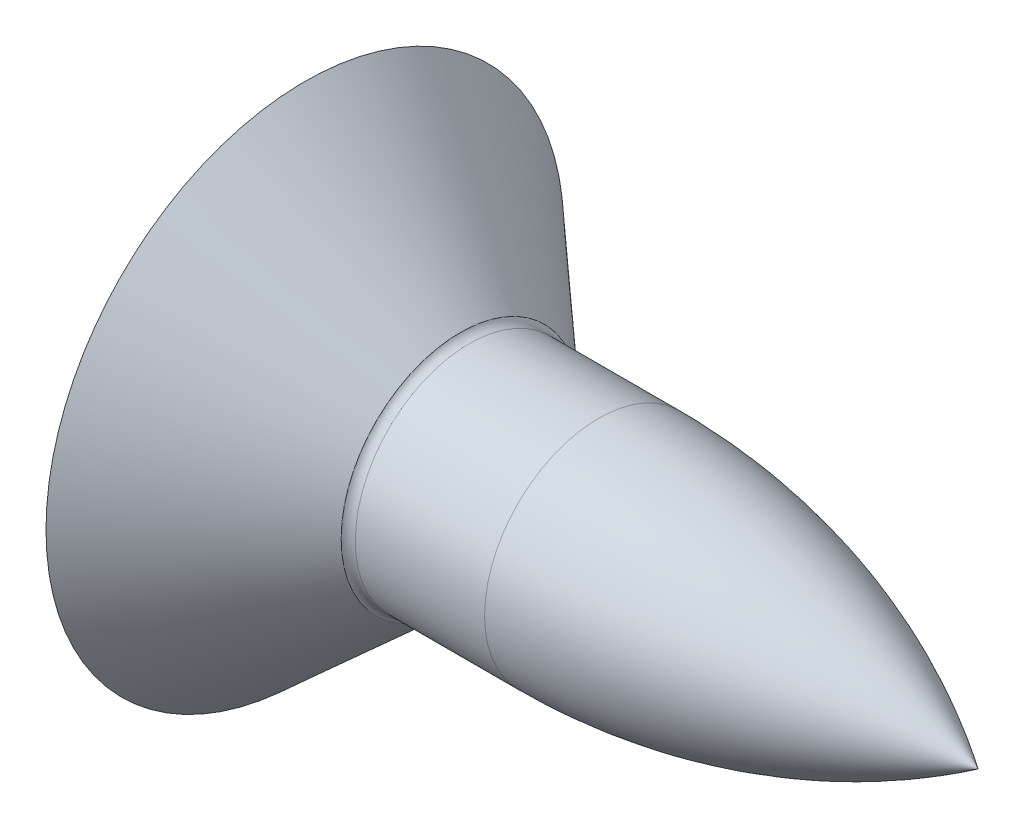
ISO-10303-21;
HEADER;
FILE_DESCRIPTION(('STEP AP214'),'2;1');
FILE_NAME('part.step','',(''),(''),'','','');
FILE_SCHEMA(('AUTOMOTIVE_DESIGN { 1 0 10303 214 1 1 1 1 }'));
ENDSEC;
DATA;
#1=APPLICATION_CONTEXT('core data for automotive mechanical design processes');
#2=APPLICATION_PROTOCOL_DEFINITION('international standard','automotive_design',2000,#1);
#3=PRODUCT_CONTEXT('',#1,'mechanical');
#4=PRODUCT('Part','Part','',(#3));
#5=PRODUCT_RELATED_PRODUCT_CATEGORY('part','',(#4));
#6=PRODUCT_DEFINITION_FORMATION('','',#4);
#7=PRODUCT_DEFINITION_CONTEXT('part definition',#1,'design');
#8=PRODUCT_DEFINITION('design','',#6,#7);
#9=PRODUCT_DEFINITION_SHAPE('','',#8);
#10=(LENGTH_UNIT() NAMED_UNIT(*) SI_UNIT(.MILLI.,.METRE.));
#11=(NAMED_UNIT(*) PLANE_ANGLE_UNIT() SI_UNIT($,.RADIAN.));
#12=(NAMED_UNIT(*) SI_UNIT($,.STERADIAN.) SOLID_ANGLE_UNIT());
#13=UNCERTAINTY_MEASURE_WITH_UNIT(LENGTH_MEASURE(1.E-05),#10,'distance_accuracy_value','');
#14=(GEOMETRIC_REPRESENTATION_CONTEXT(3) GLOBAL_UNCERTAINTY_ASSIGNED_CONTEXT((#13)) GLOBAL_UNIT_ASSIGNED_CONTEXT((#10,
#11,#12)) REPRESENTATION_CONTEXT('',''));
#15=CARTESIAN_POINT('',(0.,0.,0.));
#16=DIRECTION('',(0.,0.,1.));
#17=DIRECTION('',(1.,0.,0.));
#18=AXIS2_PLACEMENT_3D('',#15,#16,#17);
#19=CARTESIAN_POINT('',(0.,0.,0.));
#20=DIRECTION('',(-1.,0.,0.));
#21=DIRECTION('',(0.,0.,1.));
#22=AXIS2_PLACEMENT_3D('',#19,#20,#21);
#23=PLANE('',#22);
#24=CARTESIAN_POINT('',(0.,0.,0.));
#25=DIRECTION('',(-1.,0.,0.));
#26=DIRECTION('',(0.,0.,1.));
#27=AXIS2_PLACEMENT_3D('',#24,#25,#26);
#28=CIRCLE('',#27,2.5);
#29=CARTESIAN_POINT('',(0.,0.,2.5));
#30=VERTEX_POINT('',#29);
#31=EDGE_CURVE('E214',#30,#30,#28,.T.);
#32=ORIENTED_EDGE('',*,*,#31,.T.);
#33=EDGE_LOOP('',(#32));
#34=FACE_BOUND('',#33,.T.);
#35=DIRECTION('',(0.,0.,-1.));
#36=VECTOR('',#35,1.);
#37=CARTESIAN_POINT('',(0.,-0.370000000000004,1.3));
#38=LINE('',#37,#36);
#39=CARTESIAN_POINT('',(0.,-0.370000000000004,1.3));
#40=VERTEX_POINT('',#39);
#41=CARTESIAN_POINT('',(0.,-0.370000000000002,0.547609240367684));
#42=VERTEX_POINT('',#41);
#43=EDGE_CURVE('E468',#40,#42,#38,.T.);
#44=ORIENTED_EDGE('',*,*,#43,.T.);
#45=CARTESIAN_POINT('',(0.,0.,0.));
#46=DIRECTION('',(-1.,0.,0.));
#47=DIRECTION('',(0.,0.,1.));
#48=AXIS2_PLACEMENT_3D('',#45,#46,#47);
#49=CIRCLE('',#48,0.660890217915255);
#50=CARTESIAN_POINT('',(0.,-0.547609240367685,0.369999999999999));
#51=VERTEX_POINT('',#50);
#52=EDGE_CURVE('E343',#51,#42,#49,.T.);
#53=ORIENTED_EDGE('',*,*,#52,.F.);
#54=DIRECTION('',(0.,-1.,0.));
#55=VECTOR('',#54,1.);
#56=CARTESIAN_POINT('',(0.,1.3,0.37));
#57=LINE('',#56,#55);
#58=CARTESIAN_POINT('',(0.,-1.3,0.369999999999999));
#59=VERTEX_POINT('',#58);
#60=EDGE_CURVE('E416',#51,#59,#57,.T.);
#61=ORIENTED_EDGE('',*,*,#60,.T.);
#62=DIRECTION('',(0.,0.,1.));
#63=VECTOR('',#62,1.);
#64=CARTESIAN_POINT('',(0.,-1.3,-0.37));
#65=LINE('',#64,#63);
#66=CARTESIAN_POINT('',(0.,-1.3,-0.37));
#67=VERTEX_POINT('',#66);
#68=EDGE_CURVE('E219',#67,#59,#65,.T.);
#69=ORIENTED_EDGE('',*,*,#68,.F.);
#70=DIRECTION('',(0.,1.,0.));
#71=VECTOR('',#70,1.);
#72=CARTESIAN_POINT('',(0.,-1.3,-0.37));
#73=LINE('',#72,#71);
#74=CARTESIAN_POINT('',(0.,-0.547609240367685,-0.37));
#75=VERTEX_POINT('',#74);
#76=EDGE_CURVE('E49',#67,#75,#73,.T.);
#77=ORIENTED_EDGE('',*,*,#76,.T.);
#78=CARTESIAN_POINT('',(0.,-0.369999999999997,-0.547609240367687));
#79=VERTEX_POINT('',#78);
#80=EDGE_CURVE('E346',#79,#75,#49,.T.);
#81=ORIENTED_EDGE('',*,*,#80,.F.);
#82=CARTESIAN_POINT('',(0.,-0.369999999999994,-1.3));
#83=VERTEX_POINT('',#82);
#84=EDGE_CURVE('E467',#79,#83,#38,.T.);
#85=ORIENTED_EDGE('',*,*,#84,.T.);
#86=DIRECTION('',(0.,-1.,0.));
#87=VECTOR('',#86,1.);
#88=CARTESIAN_POINT('',(0.,0.370000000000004,-1.3));
#89=LINE('',#88,#87);
#90=CARTESIAN_POINT('',(0.,0.370000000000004,-1.3));
#91=VERTEX_POINT('',#90);
#92=EDGE_CURVE('E427',#91,#83,#89,.T.);
#93=ORIENTED_EDGE('',*,*,#92,.F.);
#94=DIRECTION('',(0.,0.,1.));
#95=VECTOR('',#94,1.);
#96=CARTESIAN_POINT('',(0.,0.370000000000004,-1.3));
#97=LINE('',#96,#95);
#98=CARTESIAN_POINT('',(0.,0.370000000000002,-0.547609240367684));
#99=VERTEX_POINT('',#98);
#100=EDGE_CURVE('E461',#91,#99,#97,.T.);
#101=ORIENTED_EDGE('',*,*,#100,.T.);
#102=CARTESIAN_POINT('',(0.,0.547609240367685,-0.37));
#103=VERTEX_POINT('',#102);
#104=EDGE_CURVE('E342',#103,#99,#49,.T.);
#105=ORIENTED_EDGE('',*,*,#104,.F.);
#106=CARTESIAN_POINT('',(0.,1.3,-0.37));
#107=VERTEX_POINT('',#106);
#108=EDGE_CURVE('E410',#103,#107,#73,.T.);
#109=ORIENTED_EDGE('',*,*,#108,.T.);
#110=DIRECTION('',(0.,0.,-1.));
#111=VECTOR('',#110,1.);
#112=CARTESIAN_POINT('',(0.,1.3,0.37));
#113=LINE('',#112,#111);
#114=CARTESIAN_POINT('',(0.,1.3,0.37));
#115=VERTEX_POINT('',#114);
#116=EDGE_CURVE('E417',#115,#107,#113,.T.);
#117=ORIENTED_EDGE('',*,*,#116,.F.);
#118=CARTESIAN_POINT('',(0.,0.547609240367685,0.37));
#119=VERTEX_POINT('',#118);
#120=EDGE_CURVE('E414',#115,#119,#57,.T.);
#121=ORIENTED_EDGE('',*,*,#120,.T.);
#122=CARTESIAN_POINT('',(0.,0.369999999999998,0.547609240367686));
#123=VERTEX_POINT('',#122);
#124=EDGE_CURVE('E338',#123,#119,#49,.T.);
#125=ORIENTED_EDGE('',*,*,#124,.F.);
#126=CARTESIAN_POINT('',(0.,0.369999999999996,1.3));
#127=VERTEX_POINT('',#126);
#128=EDGE_CURVE('E464',#123,#127,#97,.T.);
#129=ORIENTED_EDGE('',*,*,#128,.T.);
#130=DIRECTION('',(0.,1.,0.));
#131=VECTOR('',#130,1.);
#132=CARTESIAN_POINT('',(0.,-0.370000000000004,1.3));
#133=LINE('',#132,#131);
#134=EDGE_CURVE('E463',#40,#127,#133,.T.);
#135=ORIENTED_EDGE('',*,*,#134,.F.);
#136=EDGE_LOOP('',(#44,#53,#61,#69,#77,#81,#85,#93,#101,#105,#109,#117,#121,#125,#129,#135));
#137=FACE_BOUND('',#136,.T.);
#138=ADVANCED_FACE('F26',(#34,#137),#23,.T.);
#139=CARTESIAN_POINT('',(1.5,0.552127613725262,-0.37));
#140=DIRECTION('',(0.,0.,1.));
#141=DIRECTION('',(0.,-1.,0.));
#142=AXIS2_PLACEMENT_3D('',#139,#140,#141);
#143=PLANE('',#142);
#144=ORIENTED_EDGE('',*,*,#108,.F.);
#145=CARTESIAN_POINT('',(-1.01786528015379,0.631681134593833,-0.37));
#146=CARTESIAN_POINT('',(-0.81671122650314,0.615372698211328,-0.37));
#147=CARTESIAN_POINT('',(-0.615568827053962,0.598917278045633,-0.37));
#148=CARTESIAN_POINT('',(-0.213313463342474,0.565594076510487,-0.37));
#149=CARTESIAN_POINT('',(-0.0122004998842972,0.548726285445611,-0.37));
#150=CARTESIAN_POINT('',(0.38998037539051,0.514460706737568,-0.37));
#151=CARTESIAN_POINT('',(0.591048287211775,0.497062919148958,-0.37));
#152=CARTESIAN_POINT('',(0.993117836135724,0.461546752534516,-0.37));
#153=CARTESIAN_POINT('',(1.19411947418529,0.443428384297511,-0.37));
#154=CARTESIAN_POINT('',(1.51280354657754,0.413874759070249,-0.37));
#155=CARTESIAN_POINT('',(1.63051742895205,0.402779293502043,-0.37));
#156=CARTESIAN_POINT('',(1.86590055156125,0.380130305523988,-0.37));
#157=CARTESIAN_POINT('',(1.98356979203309,0.368576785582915,-0.37));
#158=CARTESIAN_POINT('',(2.21885433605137,0.344876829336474,-0.37));
#159=CARTESIAN_POINT('',(2.33646963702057,0.332730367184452,-0.37));
#160=CARTESIAN_POINT('',(2.57161134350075,0.30758754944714,-0.37));
#161=CARTESIAN_POINT('',(2.68913774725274,0.294591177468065,-0.37));
#162=CARTESIAN_POINT('',(2.80660252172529,0.281041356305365,-0.37));
#163=B_SPLINE_CURVE_WITH_KNOTS('',3,(#145,#146,#147,#148,#149,#150,#151,#152,#153,#154,#155,
#156,#157,#158,#159,#160,#161,#162),.UNSPECIFIED.,.F.,.F.,(4,2,2,2,2,2,2,2,4),(0.,
0.605442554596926,1.21089935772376,1.81635609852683,2.42180377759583,2.77650999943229,
3.13121430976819,3.48593409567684,3.84066072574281),.UNSPECIFIED.);
#164=CARTESIAN_POINT('',(1.5,0.415013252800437,-0.370000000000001));
#165=VERTEX_POINT('',#164);
#166=EDGE_CURVE('E251',#103,#165,#163,.T.);
#167=ORIENTED_EDGE('',*,*,#166,.T.);
#168=DIRECTION('',(0.,1.,0.));
#169=VECTOR('',#168,1.);
#170=CARTESIAN_POINT('',(1.5,-0.552127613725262,-0.37));
#171=LINE('',#170,#169);
#172=CARTESIAN_POINT('',(1.5,0.552127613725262,-0.37));
#173=VERTEX_POINT('',#172);
#174=EDGE_CURVE('E400',#165,#173,#171,.T.);
#175=ORIENTED_EDGE('',*,*,#174,.T.);
#176=DIRECTION('',(0.89493436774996,-0.446197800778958,0.));
#177=VECTOR('',#176,1.);
#178=CARTESIAN_POINT('',(0.,1.3,-0.37));
#179=LINE('',#178,#177);
#180=EDGE_CURVE('E408',#107,#173,#179,.T.);
#181=ORIENTED_EDGE('',*,*,#180,.F.);
#182=EDGE_LOOP('',(#144,#167,#175,#181));
#183=FACE_BOUND('',#182,.T.);
#184=ADVANCED_FACE('F183',(#183),#143,.T.);
#185=CARTESIAN_POINT('',(1.5,-0.552127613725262,-0.37));
#186=VERTEX_POINT('',#185);
#187=CARTESIAN_POINT('',(1.5,-0.415013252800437,-0.370000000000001));
#188=VERTEX_POINT('',#187);
#189=EDGE_CURVE('E395',#186,#188,#171,.T.);
#190=ORIENTED_EDGE('',*,*,#189,.T.);
#191=CARTESIAN_POINT('',(-1.01786528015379,-0.631681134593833,-0.37));
#192=CARTESIAN_POINT('',(-0.81671122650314,-0.615372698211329,-0.37));
#193=CARTESIAN_POINT('',(-0.615568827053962,-0.598917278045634,-0.37));
#194=CARTESIAN_POINT('',(-0.213313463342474,-0.565594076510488,-0.37));
#195=CARTESIAN_POINT('',(-0.012200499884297,-0.548726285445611,-0.37));
#196=CARTESIAN_POINT('',(0.38998037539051,-0.514460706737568,-0.37));
#197=CARTESIAN_POINT('',(0.591048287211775,-0.497062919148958,-0.37));
#198=CARTESIAN_POINT('',(0.993117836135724,-0.461546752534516,-0.37));
#199=CARTESIAN_POINT('',(1.19411947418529,-0.443428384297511,-0.37));
#200=CARTESIAN_POINT('',(1.51280354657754,-0.413874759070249,-0.37));
#201=CARTESIAN_POINT('',(1.63051742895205,-0.402779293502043,-0.37));
#202=CARTESIAN_POINT('',(1.86590055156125,-0.380130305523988,-0.37));
#203=CARTESIAN_POINT('',(1.9835697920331,-0.368576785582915,-0.37));
#204=CARTESIAN_POINT('',(2.21885433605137,-0.344876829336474,-0.37));
#205=CARTESIAN_POINT('',(2.33646963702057,-0.332730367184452,-0.37));
#206=CARTESIAN_POINT('',(2.57161134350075,-0.30758754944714,-0.37));
#207=CARTESIAN_POINT('',(2.68913774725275,-0.294591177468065,-0.37));
#208=CARTESIAN_POINT('',(2.80660252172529,-0.281041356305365,-0.37));
#209=B_SPLINE_CURVE_WITH_KNOTS('',3,(#191,#192,#193,#194,#195,#196,#197,#198,#199,#200,#201,
#202,#203,#204,#205,#206,#207,#208),.UNSPECIFIED.,.F.,.F.,(4,2,2,2,2,2,2,2,4),(0.,
0.605442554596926,1.21089935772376,1.81635609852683,2.42180377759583,2.77650999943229,
3.13121430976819,3.48593409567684,3.84066072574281),.UNSPECIFIED.);
#210=EDGE_CURVE('E245',#188,#75,#209,.F.);
#211=ORIENTED_EDGE('',*,*,#210,.T.);
#212=ORIENTED_EDGE('',*,*,#76,.F.);
#213=DIRECTION('',(0.89493436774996,0.446197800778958,0.));
#214=VECTOR('',#213,1.);
#215=CARTESIAN_POINT('',(0.,-1.3,-0.37));
#216=LINE('',#215,#214);
#217=EDGE_CURVE('E404',#67,#186,#216,.T.);
#218=ORIENTED_EDGE('',*,*,#217,.T.);
#219=EDGE_LOOP('',(#190,#211,#212,#218));
#220=FACE_BOUND('',#219,.T.);
#221=ADVANCED_FACE('F190',(#220),#143,.T.);
#222=CARTESIAN_POINT('',(1.5,-0.552127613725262,0.369999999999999));
#223=DIRECTION('',(0.,0.,-1.));
#224=DIRECTION('',(0.,1.,0.));
#225=AXIS2_PLACEMENT_3D('',#222,#223,#224);
#226=PLANE('',#225);
#227=DIRECTION('',(0.,-1.,0.));
#228=VECTOR('',#227,1.);
#229=CARTESIAN_POINT('',(1.5,0.552127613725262,0.37));
#230=LINE('',#229,#228);
#231=CARTESIAN_POINT('',(1.5,0.552127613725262,0.37));
#232=VERTEX_POINT('',#231);
#233=CARTESIAN_POINT('',(1.5,0.415013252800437,0.370000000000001));
#234=VERTEX_POINT('',#233);
#235=EDGE_CURVE('E390',#232,#234,#230,.T.);
#236=ORIENTED_EDGE('',*,*,#235,.T.);
#237=CARTESIAN_POINT('',(-1.01786528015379,0.631681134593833,0.37));
#238=CARTESIAN_POINT('',(-0.81671122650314,0.615372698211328,0.37));
#239=CARTESIAN_POINT('',(-0.615568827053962,0.598917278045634,0.37));
#240=CARTESIAN_POINT('',(-0.213313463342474,0.565594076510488,0.37));
#241=CARTESIAN_POINT('',(-0.0122004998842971,0.548726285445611,0.37));
#242=CARTESIAN_POINT('',(0.38998037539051,0.514460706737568,0.37));
#243=CARTESIAN_POINT('',(0.591048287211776,0.497062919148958,0.37));
#244=CARTESIAN_POINT('',(0.993117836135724,0.461546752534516,0.37));
#245=CARTESIAN_POINT('',(1.19411947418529,0.443428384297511,0.37));
#246=CARTESIAN_POINT('',(1.51280354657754,0.413874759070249,0.37));
#247=CARTESIAN_POINT('',(1.63051742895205,0.402779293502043,0.37));
#248=CARTESIAN_POINT('',(1.86590055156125,0.380130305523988,0.37));
#249=CARTESIAN_POINT('',(1.9835697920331,0.368576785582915,0.37));
#250=CARTESIAN_POINT('',(2.21885433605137,0.344876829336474,0.37));
#251=CARTESIAN_POINT('',(2.33646963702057,0.332730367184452,0.37));
#252=CARTESIAN_POINT('',(2.57161134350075,0.307587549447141,0.37));
#253=CARTESIAN_POINT('',(2.68913774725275,0.294591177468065,0.37));
#254=CARTESIAN_POINT('',(2.80660252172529,0.281041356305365,0.37));
#255=B_SPLINE_CURVE_WITH_KNOTS('',3,(#237,#238,#239,#240,#241,#242,#243,#244,#245,#246,#247,
#248,#249,#250,#251,#252,#253,#254),.UNSPECIFIED.,.F.,.F.,(4,2,2,2,2,2,2,2,4),(0.,
0.605442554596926,1.21089935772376,1.81635609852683,2.42180377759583,2.77650999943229,
3.13121430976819,3.48593409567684,3.84066072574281),.UNSPECIFIED.);
#256=EDGE_CURVE('E300',#234,#119,#255,.F.);
#257=ORIENTED_EDGE('',*,*,#256,.T.);
#258=ORIENTED_EDGE('',*,*,#120,.F.);
#259=DIRECTION('',(0.89493436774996,-0.446197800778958,0.));
#260=VECTOR('',#259,1.);
#261=CARTESIAN_POINT('',(0.,1.3,0.37));
#262=LINE('',#261,#260);
#263=EDGE_CURVE('E407',#115,#232,#262,.T.);
#264=ORIENTED_EDGE('',*,*,#263,.T.);
#265=EDGE_LOOP('',(#236,#257,#258,#264));
#266=FACE_BOUND('',#265,.T.);
#267=ADVANCED_FACE('F240',(#266),#226,.T.);
#268=ORIENTED_EDGE('',*,*,#60,.F.);
#269=CARTESIAN_POINT('',(-1.01786528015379,-0.631681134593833,0.369999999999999));
#270=CARTESIAN_POINT('',(-0.81671122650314,-0.615372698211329,0.369999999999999));
#271=CARTESIAN_POINT('',(-0.615568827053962,-0.598917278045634,0.369999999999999));
#272=CARTESIAN_POINT('',(-0.213313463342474,-0.565594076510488,0.369999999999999));
#273=CARTESIAN_POINT('',(-0.0122004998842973,-0.548726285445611,0.369999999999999));
#274=CARTESIAN_POINT('',(0.38998037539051,-0.514460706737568,0.369999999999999));
#275=CARTESIAN_POINT('',(0.591048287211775,-0.497062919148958,0.369999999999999));
#276=CARTESIAN_POINT('',(0.993117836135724,-0.461546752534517,0.369999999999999));
#277=CARTESIAN_POINT('',(1.19411947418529,-0.443428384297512,0.369999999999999));
#278=CARTESIAN_POINT('',(1.51280354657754,-0.41387475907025,0.369999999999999));
#279=CARTESIAN_POINT('',(1.63051742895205,-0.402779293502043,0.37));
#280=CARTESIAN_POINT('',(1.86590055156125,-0.380130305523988,0.37));
#281=CARTESIAN_POINT('',(1.98356979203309,-0.368576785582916,0.37));
#282=CARTESIAN_POINT('',(2.21885433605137,-0.344876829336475,0.37));
#283=CARTESIAN_POINT('',(2.33646963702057,-0.332730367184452,0.37));
#284=CARTESIAN_POINT('',(2.57161134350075,-0.307587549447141,0.37));
#285=CARTESIAN_POINT('',(2.68913774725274,-0.294591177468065,0.37));
#286=CARTESIAN_POINT('',(2.80660252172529,-0.281041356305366,0.37));
#287=B_SPLINE_CURVE_WITH_KNOTS('',3,(#269,#270,#271,#272,#273,#274,#275,#276,#277,#278,#279,
#280,#281,#282,#283,#284,#285,#286),.UNSPECIFIED.,.F.,.F.,(4,2,2,2,2,2,2,2,4),(0.,
0.605442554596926,1.21089935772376,1.81635609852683,2.42180377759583,2.77650999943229,
3.13121430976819,3.48593409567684,3.84066072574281),.UNSPECIFIED.);
#288=CARTESIAN_POINT('',(1.5,-0.415013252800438,0.37));
#289=VERTEX_POINT('',#288);
#290=EDGE_CURVE('E295',#51,#289,#287,.T.);
#291=ORIENTED_EDGE('',*,*,#290,.T.);
#292=CARTESIAN_POINT('',(1.5,-0.552127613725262,0.369999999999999));
#293=VERTEX_POINT('',#292);
#294=EDGE_CURVE('E392',#289,#293,#230,.T.);
#295=ORIENTED_EDGE('',*,*,#294,.T.);
#296=DIRECTION('',(0.89493436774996,0.446197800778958,0.));
#297=VECTOR('',#296,1.);
#298=CARTESIAN_POINT('',(0.,-1.3,0.369999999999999));
#299=LINE('',#298,#297);
#300=EDGE_CURVE('E401',#59,#293,#299,.T.);
#301=ORIENTED_EDGE('',*,*,#300,.F.);
#302=EDGE_LOOP('',(#268,#291,#295,#301));
#303=FACE_BOUND('',#302,.T.);
#304=ADVANCED_FACE('F442',(#303),#226,.T.);
#305=CARTESIAN_POINT('',(1.5,0.552127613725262,-0.37));
#306=DIRECTION('',(-1.,0.,0.));
#307=DIRECTION('',(0.,0.,1.));
#308=AXIS2_PLACEMENT_3D('',#305,#306,#307);
#309=PLANE('',#308);
#310=DIRECTION('',(0.,1.,0.));
#311=VECTOR('',#310,1.);
#312=CARTESIAN_POINT('',(1.5,-0.370000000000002,0.55212761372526));
#313=LINE('',#312,#311);
#314=CARTESIAN_POINT('',(1.5,-0.370000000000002,0.55212761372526));
#315=VERTEX_POINT('',#314);
#316=CARTESIAN_POINT('',(1.5,-0.0655064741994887,0.552127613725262));
#317=VERTEX_POINT('',#316);
#318=EDGE_CURVE('E487',#315,#317,#313,.T.);
#319=ORIENTED_EDGE('',*,*,#318,.T.);
#320=CARTESIAN_POINT('',(1.5,0.,0.));
#321=DIRECTION('',(-1.,0.,0.));
#322=DIRECTION('',(0.,0.,1.));
#323=AXIS2_PLACEMENT_3D('',#320,#321,#322);
#324=CIRCLE('',#323,0.556);
#325=CARTESIAN_POINT('',(1.5,-0.370000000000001,0.415013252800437));
#326=VERTEX_POINT('',#325);
#327=EDGE_CURVE('E355',#326,#317,#324,.T.);
#328=ORIENTED_EDGE('',*,*,#327,.F.);
#329=DIRECTION('',(0.,0.,-1.));
#330=VECTOR('',#329,1.);
#331=CARTESIAN_POINT('',(1.5,-0.370000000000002,0.55212761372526));
#332=LINE('',#331,#330);
#333=EDGE_CURVE('E490',#315,#326,#332,.T.);
#334=ORIENTED_EDGE('',*,*,#333,.F.);
#335=EDGE_LOOP('',(#319,#328,#334));
#336=FACE_BOUND('',#335,.T.);
#337=ADVANCED_FACE('F438',(#336),#309,.T.);
#338=ORIENTED_EDGE('',*,*,#294,.F.);
#339=CARTESIAN_POINT('',(1.5,-0.552127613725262,0.0655064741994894));
#340=VERTEX_POINT('',#339);
#341=EDGE_CURVE('E360',#340,#289,#324,.T.);
#342=ORIENTED_EDGE('',*,*,#341,.F.);
#343=DIRECTION('',(0.,0.,1.));
#344=VECTOR('',#343,1.);
#345=CARTESIAN_POINT('',(1.5,-0.552127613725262,-0.37));
#346=LINE('',#345,#344);
#347=EDGE_CURVE('E456',#340,#293,#346,.T.);
#348=ORIENTED_EDGE('',*,*,#347,.T.);
#349=EDGE_LOOP('',(#338,#342,#348));
#350=FACE_BOUND('',#349,.T.);
#351=ADVANCED_FACE('F441',(#350),#309,.T.);
#352=CARTESIAN_POINT('',(1.5,-0.552127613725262,-0.0655064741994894));
#353=VERTEX_POINT('',#352);
#354=EDGE_CURVE('E405',#186,#353,#346,.T.);
#355=ORIENTED_EDGE('',*,*,#354,.T.);
#356=EDGE_CURVE('E364',#188,#353,#324,.T.);
#357=ORIENTED_EDGE('',*,*,#356,.F.);
#358=ORIENTED_EDGE('',*,*,#189,.F.);
#359=EDGE_LOOP('',(#355,#357,#358));
#360=FACE_BOUND('',#359,.T.);
#361=ADVANCED_FACE('F459',(#360),#309,.T.);
#362=CARTESIAN_POINT('',(1.5,-0.369999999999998,-0.415013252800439));
#363=VERTEX_POINT('',#362);
#364=CARTESIAN_POINT('',(1.5,-0.369999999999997,-0.552127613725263));
#365=VERTEX_POINT('',#364);
#366=EDGE_CURVE('E489',#363,#365,#332,.T.);
#367=ORIENTED_EDGE('',*,*,#366,.F.);
#368=CARTESIAN_POINT('',(1.5,-0.0655064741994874,-0.552127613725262));
#369=VERTEX_POINT('',#368);
#370=EDGE_CURVE('E369',#369,#363,#324,.T.);
#371=ORIENTED_EDGE('',*,*,#370,.F.);
#372=DIRECTION('',(0.,-1.,0.));
#373=VECTOR('',#372,1.);
#374=CARTESIAN_POINT('',(1.5,0.370000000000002,-0.55212761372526));
#375=LINE('',#374,#373);
#376=EDGE_CURVE('E491',#369,#365,#375,.T.);
#377=ORIENTED_EDGE('',*,*,#376,.T.);
#378=EDGE_LOOP('',(#367,#371,#377));
#379=FACE_BOUND('',#378,.T.);
#380=ADVANCED_FACE('F436',(#379),#309,.T.);
#381=CARTESIAN_POINT('',(1.5,0.370000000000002,-0.55212761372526));
#382=VERTEX_POINT('',#381);
#383=CARTESIAN_POINT('',(1.5,0.0655064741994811,-0.552127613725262));
#384=VERTEX_POINT('',#383);
#385=EDGE_CURVE('E258',#382,#384,#375,.T.);
#386=ORIENTED_EDGE('',*,*,#385,.T.);
#387=CARTESIAN_POINT('',(1.5,0.370000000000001,-0.415013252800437));
#388=VERTEX_POINT('',#387);
#389=EDGE_CURVE('E41',#388,#384,#324,.T.);
#390=ORIENTED_EDGE('',*,*,#389,.F.);
#391=DIRECTION('',(0.,0.,1.));
#392=VECTOR('',#391,1.);
#393=CARTESIAN_POINT('',(1.5,0.370000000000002,-0.55212761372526));
#394=LINE('',#393,#392);
#395=EDGE_CURVE('E484',#382,#388,#394,.T.);
#396=ORIENTED_EDGE('',*,*,#395,.F.);
#397=EDGE_LOOP('',(#386,#390,#396));
#398=FACE_BOUND('',#397,.T.);
#399=ADVANCED_FACE('F430',(#398),#309,.T.);
#400=ORIENTED_EDGE('',*,*,#174,.F.);
#401=CARTESIAN_POINT('',(1.5,0.552127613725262,-0.0655064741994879));
#402=VERTEX_POINT('',#401);
#403=EDGE_CURVE('E374',#402,#165,#324,.T.);
#404=ORIENTED_EDGE('',*,*,#403,.F.);
#405=DIRECTION('',(0.,0.,-1.));
#406=VECTOR('',#405,1.);
#407=CARTESIAN_POINT('',(1.5,0.552127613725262,0.37));
#408=LINE('',#407,#406);
#409=EDGE_CURVE('E388',#402,#173,#408,.T.);
#410=ORIENTED_EDGE('',*,*,#409,.T.);
#411=EDGE_LOOP('',(#400,#404,#410));
#412=FACE_BOUND('',#411,.T.);
#413=ADVANCED_FACE('F428',(#412),#309,.T.);
#414=CARTESIAN_POINT('',(1.5,0.552127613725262,0.0655064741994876));
#415=VERTEX_POINT('',#414);
#416=EDGE_CURVE('E385',#232,#415,#408,.T.);
#417=ORIENTED_EDGE('',*,*,#416,.T.);
#418=EDGE_CURVE('E354',#234,#415,#324,.T.);
#419=ORIENTED_EDGE('',*,*,#418,.F.);
#420=ORIENTED_EDGE('',*,*,#235,.F.);
#421=EDGE_LOOP('',(#417,#419,#420));
#422=FACE_BOUND('',#421,.T.);
#423=ADVANCED_FACE('F389',(#422),#309,.T.);
#424=CARTESIAN_POINT('',(1.5,0.369999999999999,0.415013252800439));
#425=VERTEX_POINT('',#424);
#426=CARTESIAN_POINT('',(1.5,0.369999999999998,0.552127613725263));
#427=VERTEX_POINT('',#426);
#428=EDGE_CURVE('E257',#425,#427,#394,.T.);
#429=ORIENTED_EDGE('',*,*,#428,.F.);
#430=CARTESIAN_POINT('',(1.5,0.0655064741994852,0.552127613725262));
#431=VERTEX_POINT('',#430);
#432=EDGE_CURVE('E348',#431,#425,#324,.T.);
#433=ORIENTED_EDGE('',*,*,#432,.F.);
#434=EDGE_CURVE('E486',#431,#427,#313,.T.);
#435=ORIENTED_EDGE('',*,*,#434,.T.);
#436=EDGE_LOOP('',(#429,#433,#435));
#437=FACE_BOUND('',#436,.T.);
#438=ADVANCED_FACE('F236',(#437),#309,.T.);
#439=CARTESIAN_POINT('',(1.5,0.552127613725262,0.37));
#440=DIRECTION('',(0.446197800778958,0.89493436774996,0.));
#441=DIRECTION('',(-0.89493436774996,0.446197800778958,0.));
#442=AXIS2_PLACEMENT_3D('',#439,#440,#441);
#443=PLANE('',#442);
#444=CARTESIAN_POINT('',(2.47007520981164,0.0684659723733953,0.));
#445=DIRECTION('',(0.446197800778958,0.89493436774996,0.));
#446=DIRECTION('',(-0.89493436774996,0.446197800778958,0.));
#447=AXIS2_PLACEMENT_3D('',#444,#445,#446);
#448=ELLIPSE('',#447,1.09405678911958,0.483340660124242);
#449=EDGE_CURVE('E309',#415,#402,#448,.F.);
#450=ORIENTED_EDGE('',*,*,#449,.F.);
#451=ORIENTED_EDGE('',*,*,#416,.F.);
#452=ORIENTED_EDGE('',*,*,#263,.F.);
#453=ORIENTED_EDGE('',*,*,#116,.T.);
#454=ORIENTED_EDGE('',*,*,#180,.T.);
#455=ORIENTED_EDGE('',*,*,#409,.F.);
#456=EDGE_LOOP('',(#450,#451,#452,#453,#454,#455));
#457=FACE_BOUND('',#456,.T.);
#458=ADVANCED_FACE('F233',(#457),#443,.F.);
#459=CARTESIAN_POINT('',(0.,-1.3,-0.37));
#460=DIRECTION('',(0.446197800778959,-0.89493436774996,0.));
#461=DIRECTION('',(0.89493436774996,0.446197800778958,0.));
#462=AXIS2_PLACEMENT_3D('',#459,#460,#461);
#463=PLANE('',#462);
#464=CARTESIAN_POINT('',(2.47007520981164,-0.0684659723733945,0.));
#465=DIRECTION('',(0.446197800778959,-0.89493436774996,0.));
#466=DIRECTION('',(-0.89493436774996,-0.446197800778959,0.));
#467=AXIS2_PLACEMENT_3D('',#464,#465,#466);
#468=ELLIPSE('',#467,1.09405678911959,0.483340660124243);
#469=EDGE_CURVE('E313',#353,#340,#468,.F.);
#470=ORIENTED_EDGE('',*,*,#469,.F.);
#471=ORIENTED_EDGE('',*,*,#354,.F.);
#472=ORIENTED_EDGE('',*,*,#217,.F.);
#473=ORIENTED_EDGE('',*,*,#68,.T.);
#474=ORIENTED_EDGE('',*,*,#300,.T.);
#475=ORIENTED_EDGE('',*,*,#347,.F.);
#476=EDGE_LOOP('',(#470,#471,#472,#473,#474,#475));
#477=FACE_BOUND('',#476,.T.);
#478=ADVANCED_FACE('F235',(#477),#463,.F.);
#479=CARTESIAN_POINT('',(1.5,0.369999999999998,0.552127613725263));
#480=DIRECTION('',(0.,-1.,0.));
#481=DIRECTION('',(0.,0.,-1.));
#482=AXIS2_PLACEMENT_3D('',#479,#480,#481);
#483=PLANE('',#482);
#484=ORIENTED_EDGE('',*,*,#128,.F.);
#485=CARTESIAN_POINT('',(-1.01786528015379,0.369999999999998,0.631681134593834));
#486=CARTESIAN_POINT('',(-0.81671122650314,0.369999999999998,0.61537269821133));
#487=CARTESIAN_POINT('',(-0.615568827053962,0.369999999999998,0.598917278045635));
#488=CARTESIAN_POINT('',(-0.213313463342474,0.369999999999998,0.565594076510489));
#489=CARTESIAN_POINT('',(-0.0122004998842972,0.369999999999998,0.548726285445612));
#490=CARTESIAN_POINT('',(0.38998037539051,0.369999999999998,0.514460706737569));
#491=CARTESIAN_POINT('',(0.591048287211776,0.369999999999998,0.497062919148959));
#492=CARTESIAN_POINT('',(0.993117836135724,0.369999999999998,0.461546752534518));
#493=CARTESIAN_POINT('',(1.19411947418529,0.369999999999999,0.443428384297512));
#494=CARTESIAN_POINT('',(1.51280354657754,0.369999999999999,0.41387475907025));
#495=CARTESIAN_POINT('',(1.63051742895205,0.369999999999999,0.402779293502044));
#496=CARTESIAN_POINT('',(1.86590055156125,0.369999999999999,0.380130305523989));
#497=CARTESIAN_POINT('',(1.9835697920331,0.369999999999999,0.368576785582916));
#498=CARTESIAN_POINT('',(2.21885433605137,0.369999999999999,0.344876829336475));
#499=CARTESIAN_POINT('',(2.33646963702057,0.369999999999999,0.332730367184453));
#500=CARTESIAN_POINT('',(2.57161134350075,0.369999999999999,0.307587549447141));
#501=CARTESIAN_POINT('',(2.68913774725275,0.369999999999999,0.294591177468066));
#502=CARTESIAN_POINT('',(2.80660252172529,0.369999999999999,0.281041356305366));
#503=B_SPLINE_CURVE_WITH_KNOTS('',3,(#485,#486,#487,#488,#489,#490,#491,#492,#493,#494,#495,
#496,#497,#498,#499,#500,#501,#502),.UNSPECIFIED.,.F.,.F.,(4,2,2,2,2,2,2,2,4),(0.,
0.605442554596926,1.21089935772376,1.81635609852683,2.42180377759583,2.77650999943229,
3.13121430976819,3.48593409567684,3.84066072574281),.UNSPECIFIED.);
#504=EDGE_CURVE('E288',#123,#425,#503,.T.);
#505=ORIENTED_EDGE('',*,*,#504,.T.);
#506=ORIENTED_EDGE('',*,*,#428,.T.);
#507=DIRECTION('',(0.89493436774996,0.,-0.446197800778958));
#508=VECTOR('',#507,1.);
#509=CARTESIAN_POINT('',(0.,0.369999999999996,1.3));
#510=LINE('',#509,#508);
#511=EDGE_CURVE('E475',#127,#427,#510,.T.);
#512=ORIENTED_EDGE('',*,*,#511,.F.);
#513=EDGE_LOOP('',(#484,#505,#506,#512));
#514=FACE_BOUND('',#513,.T.);
#515=ADVANCED_FACE('F446',(#514),#483,.T.);
#516=CARTESIAN_POINT('',(1.5,-0.369999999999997,-0.552127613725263));
#517=DIRECTION('',(0.,1.,0.));
#518=DIRECTION('',(0.,0.,1.));
#519=AXIS2_PLACEMENT_3D('',#516,#517,#518);
#520=PLANE('',#519);
#521=ORIENTED_EDGE('',*,*,#333,.T.);
#522=CARTESIAN_POINT('',(-1.01786528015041,-0.370000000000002,0.631681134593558));
#523=CARTESIAN_POINT('',(-0.816711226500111,-0.370000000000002,0.61537269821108));
#524=CARTESIAN_POINT('',(-0.615568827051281,-0.370000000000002,0.598917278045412));
#525=CARTESIAN_POINT('',(-0.213313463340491,-0.370000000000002,0.56559407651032));
#526=CARTESIAN_POINT('',(-0.012200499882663,-0.370000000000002,0.548726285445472));
#527=CARTESIAN_POINT('',(0.389980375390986,-0.370000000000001,0.514460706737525));
#528=CARTESIAN_POINT('',(0.591048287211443,-0.370000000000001,0.497062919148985));
#529=CARTESIAN_POINT('',(0.993117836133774,-0.370000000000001,0.461546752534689));
#530=CARTESIAN_POINT('',(1.19411947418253,-0.370000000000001,0.44342838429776));
#531=CARTESIAN_POINT('',(1.51280354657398,-0.370000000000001,0.413874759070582));
#532=CARTESIAN_POINT('',(1.63051742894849,-0.370000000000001,0.40277929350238));
#533=CARTESIAN_POINT('',(1.86590055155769,-0.370000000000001,0.380130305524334));
#534=CARTESIAN_POINT('',(1.98356979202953,-0.370000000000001,0.368576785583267));
#535=CARTESIAN_POINT('',(2.21885433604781,-0.370000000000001,0.344876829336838));
#536=CARTESIAN_POINT('',(2.33646963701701,-0.370000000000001,0.332730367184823));
#537=CARTESIAN_POINT('',(2.57161134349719,-0.370000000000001,0.307587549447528));
#538=CARTESIAN_POINT('',(2.68913774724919,-0.370000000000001,0.294591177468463));
#539=CARTESIAN_POINT('',(2.80660252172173,-0.370000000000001,0.281041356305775));
#540=B_SPLINE_CURVE_WITH_KNOTS('',3,(#522,#523,#524,#525,#526,#527,#528,#529,#530,#531,#532,
#533,#534,#535,#536,#537,#538,#539),.UNSPECIFIED.,.F.,.F.,(4,2,2,2,2,2,2,2,4),(0.,
0.605442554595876,1.21089935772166,1.8163560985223,2.42180377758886,2.77650999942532,
3.13121430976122,3.48593409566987,3.84066072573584),.UNSPECIFIED.);
#541=EDGE_CURVE('E282',#326,#42,#540,.F.);
#542=ORIENTED_EDGE('',*,*,#541,.T.);
#543=ORIENTED_EDGE('',*,*,#43,.F.);
#544=DIRECTION('',(0.89493436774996,0.,-0.446197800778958));
#545=VECTOR('',#544,1.);
#546=CARTESIAN_POINT('',(0.,-0.370000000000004,1.3));
#547=LINE('',#546,#545);
#548=EDGE_CURVE('E472',#40,#315,#547,.T.);
#549=ORIENTED_EDGE('',*,*,#548,.T.);
#550=EDGE_LOOP('',(#521,#542,#543,#549));
#551=FACE_BOUND('',#550,.T.);
#552=ADVANCED_FACE('F451',(#551),#520,.T.);
#553=CARTESIAN_POINT('',(1.5,-0.370000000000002,0.55212761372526));
#554=DIRECTION('',(0.446197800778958,0.,0.89493436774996));
#555=DIRECTION('',(-0.89493436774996,0.,0.446197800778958));
#556=AXIS2_PLACEMENT_3D('',#553,#554,#555);
#557=PLANE('',#556);
#558=CARTESIAN_POINT('',(2.47007520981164,0.,0.0684659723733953));
#559=DIRECTION('',(0.446197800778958,0.,0.89493436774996));
#560=DIRECTION('',(-0.89493436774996,0.,0.446197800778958));
#561=AXIS2_PLACEMENT_3D('',#558,#559,#560);
#562=ELLIPSE('',#561,1.09405678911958,0.483340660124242);
#563=EDGE_CURVE('E325',#317,#431,#562,.F.);
#564=ORIENTED_EDGE('',*,*,#563,.F.);
#565=ORIENTED_EDGE('',*,*,#318,.F.);
#566=ORIENTED_EDGE('',*,*,#548,.F.);
#567=ORIENTED_EDGE('',*,*,#134,.T.);
#568=ORIENTED_EDGE('',*,*,#511,.T.);
#569=ORIENTED_EDGE('',*,*,#434,.F.);
#570=EDGE_LOOP('',(#564,#565,#566,#567,#568,#569));
#571=FACE_BOUND('',#570,.T.);
#572=ADVANCED_FACE('F444',(#571),#557,.F.);
#573=ORIENTED_EDGE('',*,*,#395,.T.);
#574=CARTESIAN_POINT('',(-1.01786528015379,0.370000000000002,-0.631681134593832));
#575=CARTESIAN_POINT('',(-0.81671122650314,0.370000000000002,-0.615372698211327));
#576=CARTESIAN_POINT('',(-0.615568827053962,0.370000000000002,-0.598917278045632));
#577=CARTESIAN_POINT('',(-0.213313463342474,0.370000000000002,-0.565594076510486));
#578=CARTESIAN_POINT('',(-0.0122004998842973,0.370000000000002,-0.54872628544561));
#579=CARTESIAN_POINT('',(0.38998037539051,0.370000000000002,-0.514460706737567));
#580=CARTESIAN_POINT('',(0.591048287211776,0.370000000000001,-0.497062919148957));
#581=CARTESIAN_POINT('',(0.993117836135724,0.370000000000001,-0.461546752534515));
#582=CARTESIAN_POINT('',(1.19411947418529,0.370000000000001,-0.44342838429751));
#583=CARTESIAN_POINT('',(1.51280354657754,0.370000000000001,-0.413874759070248));
#584=CARTESIAN_POINT('',(1.63051742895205,0.370000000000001,-0.402779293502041));
#585=CARTESIAN_POINT('',(1.86590055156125,0.370000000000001,-0.380130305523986));
#586=CARTESIAN_POINT('',(1.98356979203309,0.370000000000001,-0.368576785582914));
#587=CARTESIAN_POINT('',(2.21885433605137,0.370000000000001,-0.344876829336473));
#588=CARTESIAN_POINT('',(2.33646963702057,0.370000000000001,-0.332730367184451));
#589=CARTESIAN_POINT('',(2.57161134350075,0.370000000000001,-0.307587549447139));
#590=CARTESIAN_POINT('',(2.68913774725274,0.370000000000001,-0.294591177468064));
#591=CARTESIAN_POINT('',(2.80660252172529,0.370000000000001,-0.281041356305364));
#592=B_SPLINE_CURVE_WITH_KNOTS('',3,(#574,#575,#576,#577,#578,#579,#580,#581,#582,#583,#584,
#585,#586,#587,#588,#589,#590,#591),.UNSPECIFIED.,.F.,.F.,(4,2,2,2,2,2,2,2,4),(0.,
0.605442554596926,1.21089935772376,1.81635609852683,2.42180377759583,2.77650999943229,
3.13121430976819,3.48593409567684,3.84066072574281),.UNSPECIFIED.);
#593=EDGE_CURVE('E274',#388,#99,#592,.F.);
#594=ORIENTED_EDGE('',*,*,#593,.T.);
#595=ORIENTED_EDGE('',*,*,#100,.F.);
#596=DIRECTION('',(0.89493436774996,0.,0.446197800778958));
#597=VECTOR('',#596,1.);
#598=CARTESIAN_POINT('',(0.,0.370000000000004,-1.3));
#599=LINE('',#598,#597);
#600=EDGE_CURVE('E476',#91,#382,#599,.T.);
#601=ORIENTED_EDGE('',*,*,#600,.T.);
#602=EDGE_LOOP('',(#573,#594,#595,#601));
#603=FACE_BOUND('',#602,.T.);
#604=ADVANCED_FACE('F452',(#603),#483,.T.);
#605=ORIENTED_EDGE('',*,*,#84,.F.);
#606=CARTESIAN_POINT('',(-1.01786528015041,-0.369999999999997,-0.631681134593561));
#607=CARTESIAN_POINT('',(-0.81671122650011,-0.369999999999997,-0.615372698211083));
#608=CARTESIAN_POINT('',(-0.615568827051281,-0.369999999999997,-0.598917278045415));
#609=CARTESIAN_POINT('',(-0.213313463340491,-0.369999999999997,-0.565594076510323));
#610=CARTESIAN_POINT('',(-0.012200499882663,-0.369999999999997,-0.548726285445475));
#611=CARTESIAN_POINT('',(0.389980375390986,-0.369999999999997,-0.514460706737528));
#612=CARTESIAN_POINT('',(0.591048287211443,-0.369999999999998,-0.497062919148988));
#613=CARTESIAN_POINT('',(0.993117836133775,-0.369999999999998,-0.461546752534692));
#614=CARTESIAN_POINT('',(1.19411947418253,-0.369999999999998,-0.443428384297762));
#615=CARTESIAN_POINT('',(1.51280354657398,-0.369999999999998,-0.413874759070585));
#616=CARTESIAN_POINT('',(1.63051742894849,-0.369999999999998,-0.402779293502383));
#617=CARTESIAN_POINT('',(1.86590055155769,-0.369999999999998,-0.380130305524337));
#618=CARTESIAN_POINT('',(1.98356979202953,-0.369999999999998,-0.36857678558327));
#619=CARTESIAN_POINT('',(2.21885433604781,-0.369999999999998,-0.344876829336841));
#620=CARTESIAN_POINT('',(2.33646963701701,-0.369999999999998,-0.332730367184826));
#621=CARTESIAN_POINT('',(2.57161134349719,-0.369999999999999,-0.307587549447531));
#622=CARTESIAN_POINT('',(2.68913774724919,-0.369999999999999,-0.294591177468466));
#623=CARTESIAN_POINT('',(2.80660252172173,-0.369999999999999,-0.281041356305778));
#624=B_SPLINE_CURVE_WITH_KNOTS('',3,(#606,#607,#608,#609,#610,#611,#612,#613,#614,#615,#616,
#617,#618,#619,#620,#621,#622,#623),.UNSPECIFIED.,.F.,.F.,(4,2,2,2,2,2,2,2,4),(0.,
0.605442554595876,1.21089935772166,1.8163560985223,2.42180377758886,2.77650999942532,
3.13121430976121,3.48593409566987,3.84066072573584),.UNSPECIFIED.);
#625=EDGE_CURVE('E266',#79,#363,#624,.T.);
#626=ORIENTED_EDGE('',*,*,#625,.T.);
#627=ORIENTED_EDGE('',*,*,#366,.T.);
#628=DIRECTION('',(0.89493436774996,0.,0.446197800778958));
#629=VECTOR('',#628,1.);
#630=CARTESIAN_POINT('',(0.,-0.369999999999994,-1.3));
#631=LINE('',#630,#629);
#632=EDGE_CURVE('E481',#83,#365,#631,.T.);
#633=ORIENTED_EDGE('',*,*,#632,.F.);
#634=EDGE_LOOP('',(#605,#626,#627,#633));
#635=FACE_BOUND('',#634,.T.);
#636=ADVANCED_FACE('F494',(#635),#520,.T.);
#637=CARTESIAN_POINT('',(0.,0.370000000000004,-1.3));
#638=DIRECTION('',(0.446197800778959,0.,-0.89493436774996));
#639=DIRECTION('',(0.89493436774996,0.,0.446197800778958));
#640=AXIS2_PLACEMENT_3D('',#637,#638,#639);
#641=PLANE('',#640);
#642=CARTESIAN_POINT('',(2.47007520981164,0.,-0.0684659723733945));
#643=DIRECTION('',(0.446197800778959,0.,-0.89493436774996));
#644=DIRECTION('',(-0.89493436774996,0.,-0.446197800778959));
#645=AXIS2_PLACEMENT_3D('',#642,#643,#644);
#646=ELLIPSE('',#645,1.09405678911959,0.483340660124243);
#647=EDGE_CURVE('E11',#384,#369,#646,.F.);
#648=ORIENTED_EDGE('',*,*,#647,.F.);
#649=ORIENTED_EDGE('',*,*,#385,.F.);
#650=ORIENTED_EDGE('',*,*,#600,.F.);
#651=ORIENTED_EDGE('',*,*,#92,.T.);
#652=ORIENTED_EDGE('',*,*,#632,.T.);
#653=ORIENTED_EDGE('',*,*,#376,.F.);
#654=EDGE_LOOP('',(#648,#649,#650,#651,#652,#653));
#655=FACE_BOUND('',#654,.T.);
#656=ADVANCED_FACE('F207',(#655),#641,.F.);
#657=CARTESIAN_POINT('',(-25.4,0.,0.));
#658=DIRECTION('',(-1.,0.,0.));
#659=DIRECTION('',(0.,0.,1.));
#660=AXIS2_PLACEMENT_3D('',#657,#658,#659);
#661=CYLINDRICAL_SURFACE('',#660,1.1);
#662=CARTESIAN_POINT('',(1.58660254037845,0.,0.));
#663=DIRECTION('',(-1.,0.,0.));
#664=DIRECTION('',(0.,0.,1.));
#665=AXIS2_PLACEMENT_3D('',#662,#663,#664);
#666=CIRCLE('',#665,1.1);
#667=CARTESIAN_POINT('',(1.58660254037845,0.,1.1));
#668=VERTEX_POINT('',#667);
#669=EDGE_CURVE('E34',#668,#668,#666,.F.);
#670=ORIENTED_EDGE('',*,*,#669,.T.);
#671=EDGE_LOOP('',(#670));
#672=FACE_BOUND('',#671,.T.);
#673=CARTESIAN_POINT('',(2.83535819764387,0.,0.));
#674=DIRECTION('',(-1.,0.,0.));
#675=DIRECTION('',(0.,0.,1.));
#676=AXIS2_PLACEMENT_3D('',#673,#674,#675);
#677=CIRCLE('',#676,1.1);
#678=CARTESIAN_POINT('',(2.83535819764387,0.,1.1));
#679=VERTEX_POINT('',#678);
#680=EDGE_CURVE('E215',#679,#679,#677,.T.);
#681=ORIENTED_EDGE('',*,*,#680,.T.);
#682=EDGE_LOOP('',(#681));
#683=FACE_BOUND('',#682,.T.);
#684=ADVANCED_FACE('F28',(#672,#683),#661,.T.);
#685=CARTESIAN_POINT('',(0.,0.,0.));
#686=DIRECTION('',(-1.,0.,0.));
#687=DIRECTION('',(0.,0.,1.));
#688=AXIS2_PLACEMENT_3D('',#685,#686,#687);
#689=CONICAL_SURFACE('',#688,2.5,0.732815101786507);
#690=CARTESIAN_POINT('',(1.5,0.,0.));
#691=DIRECTION('',(-1.,0.,0.));
#692=DIRECTION('',(0.,0.,1.));
#693=AXIS2_PLACEMENT_3D('',#690,#691,#692);
#694=CIRCLE('',#693,1.15);
#695=CARTESIAN_POINT('',(1.5,0.,1.15));
#696=VERTEX_POINT('',#695);
#697=EDGE_CURVE('E212',#696,#696,#694,.T.);
#698=ORIENTED_EDGE('',*,*,#697,.T.);
#699=EDGE_LOOP('',(#698));
#700=FACE_BOUND('',#699,.T.);
#701=ORIENTED_EDGE('',*,*,#31,.F.);
#702=EDGE_LOOP('',(#701));
#703=FACE_BOUND('',#702,.T.);
#704=ADVANCED_FACE('F198',(#700,#703),#689,.T.);
#705=CARTESIAN_POINT('',(2.83535819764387,0.,-5.55436342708));
#706=DIRECTION('',(0.,-1.,0.));
#707=DIRECTION('',(0.,0.,1.));
#708=AXIS2_PLACEMENT_3D('',#705,#706,#707);
#709=CIRCLE('',#708,6.65436342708);
#710=TRIMMED_CURVE('',#709,(PARAMETER_VALUE(-0.58321772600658)),
(PARAMETER_VALUE(0.58321772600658)),.T.,.PARAMETER.);
#711=CARTESIAN_POINT('',(2.83535819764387,0.,0.));
#712=DIRECTION('',(-1.,0.,0.));
#713=AXIS1_PLACEMENT('',#711,#712);
#714=SURFACE_OF_REVOLUTION('',#710,#713);
#715=ORIENTED_EDGE('',*,*,#680,.F.);
#716=EDGE_LOOP('',(#715));
#717=FACE_BOUND('',#716,.T.);
#718=CARTESIAN_POINT('',(6.5,0.,0.));
#719=VERTEX_POINT('',#718);
#720=VERTEX_LOOP('',#719);
#721=FACE_BOUND('',#720,.T.);
#722=ADVANCED_FACE('F196',(#717,#721),#714,.T.);
#723=CARTESIAN_POINT('',(1.58660254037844,0.,0.));
#724=DIRECTION('',(-1.,0.,0.));
#725=DIRECTION('',(0.,0.,1.));
#726=AXIS2_PLACEMENT_3D('',#723,#724,#725);
#727=TOROIDAL_SURFACE('',#726,1.2,0.1);
#728=ORIENTED_EDGE('',*,*,#669,.F.);
#729=EDGE_LOOP('',(#728));
#730=FACE_BOUND('',#729,.T.);
#731=ORIENTED_EDGE('',*,*,#697,.F.);
#732=EDGE_LOOP('',(#731));
#733=FACE_BOUND('',#732,.T.);
#734=ADVANCED_FACE('F204',(#730,#733),#727,.F.);
#735=CARTESIAN_POINT('',(1.5,0.,0.));
#736=DIRECTION('',(-1.,0.,0.));
#737=DIRECTION('',(0.,0.,1.));
#738=AXIS2_PLACEMENT_3D('',#735,#736,#737);
#739=CONICAL_SURFACE('',#738,0.556,0.069813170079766);
#740=ORIENTED_EDGE('',*,*,#104,.T.);
#741=ORIENTED_EDGE('',*,*,#593,.F.);
#742=EDGE_CURVE('E373',#165,#388,#324,.T.);
#743=ORIENTED_EDGE('',*,*,#742,.F.);
#744=ORIENTED_EDGE('',*,*,#166,.F.);
#745=EDGE_LOOP('',(#740,#741,#743,#744));
#746=FACE_BOUND('',#745,.T.);
#747=ADVANCED_FACE('F180',(#746),#739,.F.);
#748=EDGE_CURVE('E366',#363,#188,#324,.T.);
#749=ORIENTED_EDGE('',*,*,#748,.F.);
#750=ORIENTED_EDGE('',*,*,#625,.F.);
#751=ORIENTED_EDGE('',*,*,#80,.T.);
#752=ORIENTED_EDGE('',*,*,#210,.F.);
#753=EDGE_LOOP('',(#749,#750,#751,#752));
#754=FACE_BOUND('',#753,.T.);
#755=ADVANCED_FACE('F230',(#754),#739,.F.);
#756=ORIENTED_EDGE('',*,*,#449,.T.);
#757=EDGE_CURVE('E376',#415,#402,#324,.T.);
#758=ORIENTED_EDGE('',*,*,#757,.F.);
#759=EDGE_LOOP('',(#756,#758));
#760=FACE_BOUND('',#759,.T.);
#761=ADVANCED_FACE('F602',(#760),#739,.F.);
#762=ORIENTED_EDGE('',*,*,#469,.T.);
#763=EDGE_CURVE('E362',#353,#340,#324,.T.);
#764=ORIENTED_EDGE('',*,*,#763,.F.);
#765=EDGE_LOOP('',(#762,#764));
#766=FACE_BOUND('',#765,.T.);
#767=ADVANCED_FACE('F608',(#766),#739,.F.);
#768=EDGE_CURVE('E350',#425,#234,#324,.T.);
#769=ORIENTED_EDGE('',*,*,#768,.F.);
#770=ORIENTED_EDGE('',*,*,#504,.F.);
#771=ORIENTED_EDGE('',*,*,#124,.T.);
#772=ORIENTED_EDGE('',*,*,#256,.F.);
#773=EDGE_LOOP('',(#769,#770,#771,#772));
#774=FACE_BOUND('',#773,.T.);
#775=ADVANCED_FACE('F614',(#774),#739,.F.);
#776=ORIENTED_EDGE('',*,*,#563,.T.);
#777=EDGE_CURVE('E351',#317,#431,#324,.T.);
#778=ORIENTED_EDGE('',*,*,#777,.F.);
#779=EDGE_LOOP('',(#776,#778));
#780=FACE_BOUND('',#779,.T.);
#781=ADVANCED_FACE('F620',(#780),#739,.F.);
#782=ORIENTED_EDGE('',*,*,#647,.T.);
#783=EDGE_CURVE('E371',#384,#369,#324,.T.);
#784=ORIENTED_EDGE('',*,*,#783,.F.);
#785=EDGE_LOOP('',(#782,#784));
#786=FACE_BOUND('',#785,.T.);
#787=ADVANCED_FACE('F177',(#786),#739,.F.);
#788=ORIENTED_EDGE('',*,*,#52,.T.);
#789=ORIENTED_EDGE('',*,*,#541,.F.);
#790=EDGE_CURVE('E357',#289,#326,#324,.T.);
#791=ORIENTED_EDGE('',*,*,#790,.F.);
#792=ORIENTED_EDGE('',*,*,#290,.F.);
#793=EDGE_LOOP('',(#788,#789,#791,#792));
#794=FACE_BOUND('',#793,.T.);
#795=ADVANCED_FACE('F172',(#794),#739,.F.);
#796=CARTESIAN_POINT('',(1.68065535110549,0.,0.));
#797=DIRECTION('',(-1.,0.,0.));
#798=DIRECTION('',(0.,0.,1.));
#799=AXIS2_PLACEMENT_3D('',#796,#797,#798);
#800=CONICAL_SURFACE('',#799,0.,1.25663706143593);
#801=ORIENTED_EDGE('',*,*,#432,.T.);
#802=ORIENTED_EDGE('',*,*,#768,.T.);
#803=ORIENTED_EDGE('',*,*,#418,.T.);
#804=ORIENTED_EDGE('',*,*,#757,.T.);
#805=ORIENTED_EDGE('',*,*,#403,.T.);
#806=ORIENTED_EDGE('',*,*,#742,.T.);
#807=ORIENTED_EDGE('',*,*,#389,.T.);
#808=ORIENTED_EDGE('',*,*,#783,.T.);
#809=ORIENTED_EDGE('',*,*,#370,.T.);
#810=ORIENTED_EDGE('',*,*,#748,.T.);
#811=ORIENTED_EDGE('',*,*,#356,.T.);
#812=ORIENTED_EDGE('',*,*,#763,.T.);
#813=ORIENTED_EDGE('',*,*,#341,.T.);
#814=ORIENTED_EDGE('',*,*,#790,.T.);
#815=ORIENTED_EDGE('',*,*,#327,.T.);
#816=ORIENTED_EDGE('',*,*,#777,.T.);
#817=EDGE_LOOP('',(#801,#802,#803,#804,#805,#806,#807,#808,#809,#810,#811,#812,#813,#814,#815,#816));
#818=FACE_BOUND('',#817,.T.);
#819=CARTESIAN_POINT('',(1.68065535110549,0.,0.));
#820=VERTEX_POINT('',#819);
#821=VERTEX_LOOP('',#820);
#822=FACE_BOUND('',#821,.T.);
#823=ADVANCED_FACE('F170',(#818,#822),#800,.F.);
#824=CLOSED_SHELL('',(#138,#184,#221,#267,#304,#337,#351,#361,#380,#399,#413,#423,#438,#458,
#478,#515,#552,#572,#604,#636,#656,#684,#704,#722,#734,#747,#755,#761,#767,#775,#781,#787,#795,#823));
#825=MANIFOLD_SOLID_BREP('B2',#824);
#826=ADVANCED_BREP_SHAPE_REPRESENTATION('',(#18,#825),#14);
#827=SHAPE_DEFINITION_REPRESENTATION(#9,#826);
ENDSEC;
END-ISO-10303-21;
